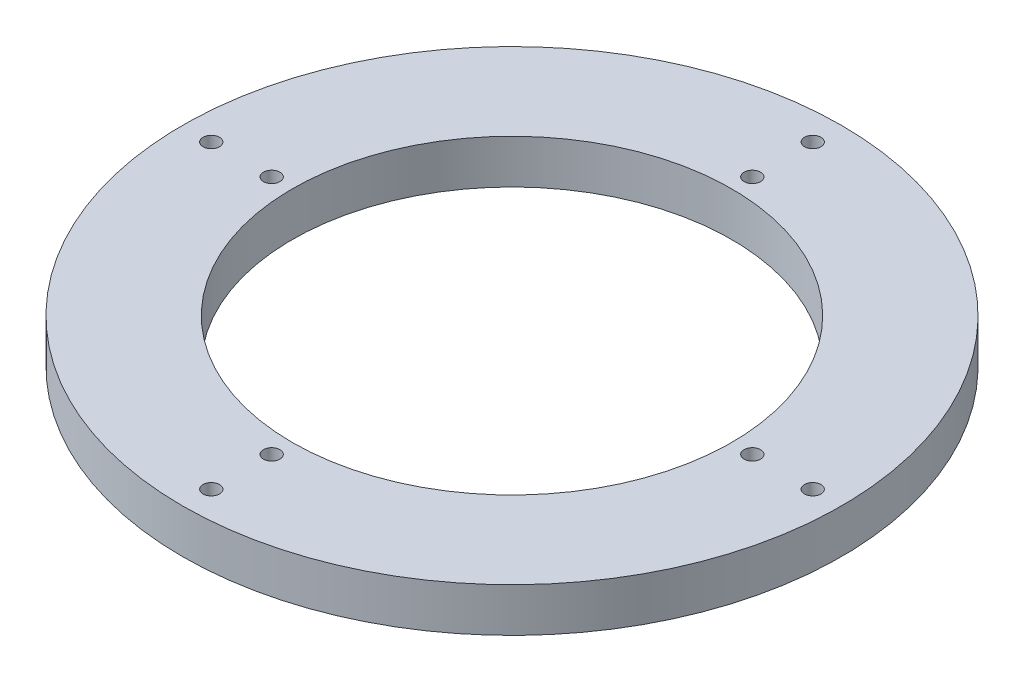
from build123d import *

# Parameters (mm, degrees)
SKETCH_1_R      = 60
SKETCH_1_R_2    = 40
SKETCH_1_R_3    = 1.5
EXTRUDE_1_DEPTH = 8


with BuildPart() as part:
    # Sketch 1 → Extrude 1 (new body)
    with BuildSketch(Plane(origin=(0, 0, 0), x_dir=(1, 0, 0), z_dir=(0, 1, 0))):
        with Locations(Location((0, 0, 0), (0, 0, 270))):
            Circle(SKETCH_1_R)
        with Locations(Location((0, 0, 0), (0, 0, 270))):
            Circle(SKETCH_1_R_2, mode=Mode.SUBTRACT)
        with Locations(Location((54.75, 0, 0), (0, 0, 270))):
            Circle(SKETCH_1_R_3, mode=Mode.SUBTRACT)
        with Locations(Location((0, -54.75, 0), (0, 0, 270))):
            Circle(SKETCH_1_R_3, mode=Mode.SUBTRACT)
        with Locations(Location((-54.75, 0, 0), (0, 0, 270))):
            Circle(SKETCH_1_R_3, mode=Mode.SUBTRACT)
        with Locations(Location((0, 54.75, 0), (0, 0, 270))):
            Circle(SKETCH_1_R_3, mode=Mode.SUBTRACT)
        with Locations(Location((43.75, 0, 0), (0, 0, 270))):
            Circle(SKETCH_1_R_3, mode=Mode.SUBTRACT)
        with Locations(Location((0, -43.75, 0), (0, 0, 270))):
            Circle(SKETCH_1_R_3, mode=Mode.SUBTRACT)
        with Locations(Location((-43.75, 0, 0), (0, 0, 270))):
            Circle(SKETCH_1_R_3, mode=Mode.SUBTRACT)
        with Locations(Location((0, 43.75, 0), (0, 0, 270))):
            Circle(SKETCH_1_R_3, mode=Mode.SUBTRACT)
    extrude(amount=EXTRUDE_1_DEPTH)


solid = part.part
